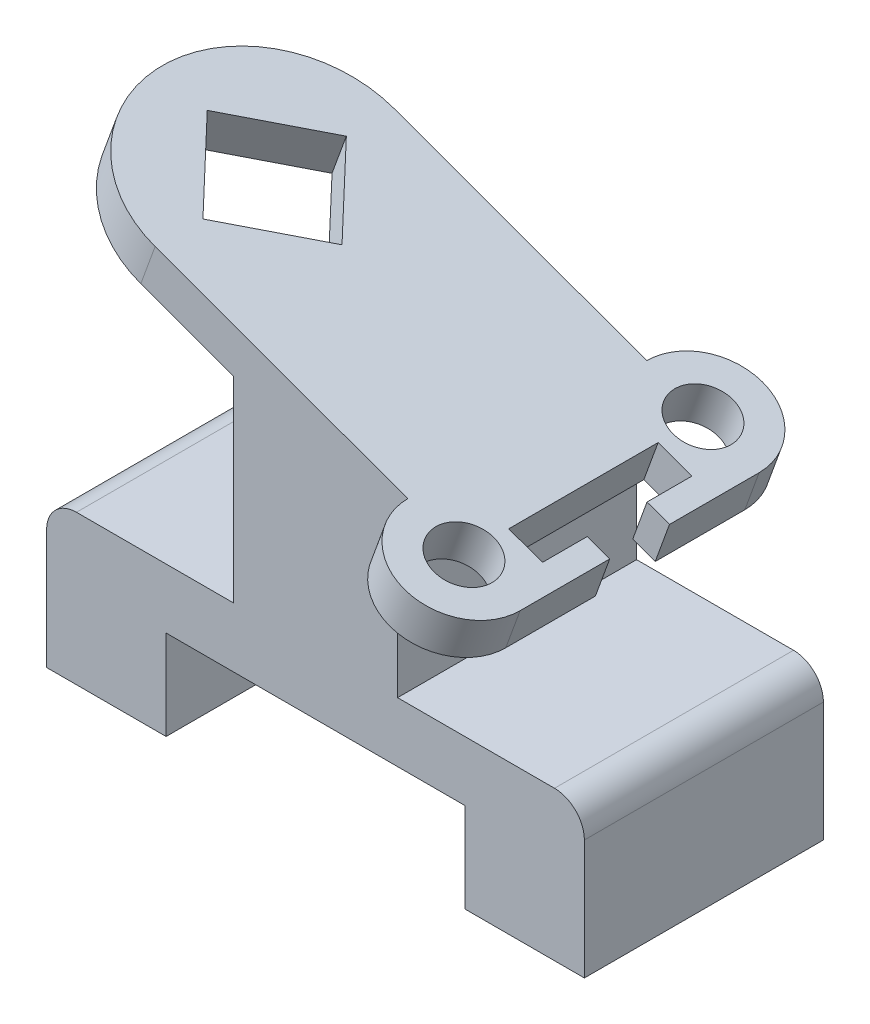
ISO-10303-21;
HEADER;
FILE_DESCRIPTION(('STEP AP214'),'2;1');
FILE_NAME('part.step','',(''),(''),'','','');
FILE_SCHEMA(('AUTOMOTIVE_DESIGN { 1 0 10303 214 1 1 1 1 }'));
ENDSEC;
DATA;
#1=APPLICATION_CONTEXT('core data for automotive mechanical design processes');
#2=APPLICATION_PROTOCOL_DEFINITION('international standard','automotive_design',2000,#1);
#3=PRODUCT_CONTEXT('',#1,'mechanical');
#4=PRODUCT('Part','Part','',(#3));
#5=PRODUCT_RELATED_PRODUCT_CATEGORY('part','',(#4));
#6=PRODUCT_DEFINITION_FORMATION('','',#4);
#7=PRODUCT_DEFINITION_CONTEXT('part definition',#1,'design');
#8=PRODUCT_DEFINITION('design','',#6,#7);
#9=PRODUCT_DEFINITION_SHAPE('','',#8);
#10=(LENGTH_UNIT() NAMED_UNIT(*) SI_UNIT(.MILLI.,.METRE.));
#11=(NAMED_UNIT(*) PLANE_ANGLE_UNIT() SI_UNIT($,.RADIAN.));
#12=(NAMED_UNIT(*) SI_UNIT($,.STERADIAN.) SOLID_ANGLE_UNIT());
#13=UNCERTAINTY_MEASURE_WITH_UNIT(LENGTH_MEASURE(1.E-05),#10,'distance_accuracy_value','');
#14=(GEOMETRIC_REPRESENTATION_CONTEXT(3) GLOBAL_UNCERTAINTY_ASSIGNED_CONTEXT((#13)) GLOBAL_UNIT_ASSIGNED_CONTEXT((#10,
#11,#12)) REPRESENTATION_CONTEXT('',''));
#15=CARTESIAN_POINT('',(0.,0.,0.));
#16=DIRECTION('',(0.,0.,1.));
#17=DIRECTION('',(1.,0.,0.));
#18=AXIS2_PLACEMENT_3D('',#15,#16,#17);
#19=CARTESIAN_POINT('',(24.8444140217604,51.2782616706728,20.));
#20=DIRECTION('',(-0.342020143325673,-0.939692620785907,0.));
#21=DIRECTION('',(0.939692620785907,-0.342020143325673,0.));
#22=AXIS2_PLACEMENT_3D('',#19,#20,#21);
#23=PLANE('',#22);
#24=DIRECTION('',(0.664463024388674,-0.241844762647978,-0.707106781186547));
#25=VECTOR('',#24,1.);
#26=CARTESIAN_POINT('',(-26.8386801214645,70.0893695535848,12.));
#27=LINE('',#26,#25);
#28=CARTESIAN_POINT('',(-26.8386801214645,70.0893695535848,12.));
#29=VERTEX_POINT('',#28);
#30=CARTESIAN_POINT('',(-15.5623686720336,65.9851278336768,0.));
#31=VERTEX_POINT('',#30);
#32=EDGE_CURVE('E255',#29,#31,#27,.T.);
#33=ORIENTED_EDGE('',*,*,#32,.F.);
#34=DIRECTION('',(0.664463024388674,-0.241844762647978,0.707106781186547));
#35=VECTOR('',#34,1.);
#36=CARTESIAN_POINT('',(-38.1149915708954,74.1936112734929,0.));
#37=LINE('',#36,#35);
#38=CARTESIAN_POINT('',(-38.1149915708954,74.1936112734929,0.));
#39=VERTEX_POINT('',#38);
#40=EDGE_CURVE('E267',#39,#29,#37,.T.);
#41=ORIENTED_EDGE('',*,*,#40,.F.);
#42=DIRECTION('',(-0.664463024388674,0.241844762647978,0.707106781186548));
#43=VECTOR('',#42,1.);
#44=CARTESIAN_POINT('',(-26.8386801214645,70.0893695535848,-12.));
#45=LINE('',#44,#43);
#46=CARTESIAN_POINT('',(-26.8386801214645,70.0893695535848,-12.));
#47=VERTEX_POINT('',#46);
#48=EDGE_CURVE('E265',#47,#39,#45,.T.);
#49=ORIENTED_EDGE('',*,*,#48,.F.);
#50=DIRECTION('',(-0.664463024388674,0.241844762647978,-0.707106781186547));
#51=VECTOR('',#50,1.);
#52=CARTESIAN_POINT('',(-15.5623686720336,65.9851278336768,0.));
#53=LINE('',#52,#51);
#54=EDGE_CURVE('E47',#31,#47,#53,.T.);
#55=ORIENTED_EDGE('',*,*,#54,.F.);
#56=EDGE_LOOP('',(#33,#41,#49,#55));
#57=FACE_BOUND('',#56,.T.);
#58=CARTESIAN_POINT('',(24.8444140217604,51.2782616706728,20.));
#59=DIRECTION('',(0.342020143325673,0.939692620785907,0.));
#60=DIRECTION('',(-0.939692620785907,0.342020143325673,0.));
#61=AXIS2_PLACEMENT_3D('',#58,#59,#60);
#62=CIRCLE('',#61,4.99999999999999);
#63=CARTESIAN_POINT('',(20.1459509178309,52.9883623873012,20.));
#64=VERTEX_POINT('',#63);
#65=EDGE_CURVE('E282',#64,#64,#62,.T.);
#66=ORIENTED_EDGE('',*,*,#65,.F.);
#67=EDGE_LOOP('',(#66));
#68=FACE_BOUND('',#67,.T.);
#69=DIRECTION('',(0.939692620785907,-0.342020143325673,0.));
#70=VECTOR('',#69,1.);
#71=CARTESIAN_POINT('',(30.4825697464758,49.2261408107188,-12.5));
#72=LINE('',#71,#70);
#73=CARTESIAN_POINT('',(24.8444140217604,51.2782616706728,-12.5));
#74=VERTEX_POINT('',#73);
#75=CARTESIAN_POINT('',(30.4825697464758,49.2261408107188,-12.5));
#76=VERTEX_POINT('',#75);
#77=EDGE_CURVE('E329',#74,#76,#72,.T.);
#78=ORIENTED_EDGE('',*,*,#77,.T.);
#79=DIRECTION('',(0.,0.,1.));
#80=VECTOR('',#79,1.);
#81=CARTESIAN_POINT('',(30.4825697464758,49.2261408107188,-5.));
#82=LINE('',#81,#80);
#83=CARTESIAN_POINT('',(30.4825697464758,49.2261408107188,-5.));
#84=VERTEX_POINT('',#83);
#85=EDGE_CURVE('E332',#76,#84,#82,.T.);
#86=ORIENTED_EDGE('',*,*,#85,.T.);
#87=DIRECTION('',(0.939692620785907,-0.342020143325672,0.));
#88=VECTOR('',#87,1.);
#89=CARTESIAN_POINT('',(34.2413402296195,47.8580602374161,-4.99999999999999));
#90=LINE('',#89,#88);
#91=CARTESIAN_POINT('',(34.2413402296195,47.8580602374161,-4.99999999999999));
#92=VERTEX_POINT('',#91);
#93=EDGE_CURVE('E334',#84,#92,#90,.T.);
#94=ORIENTED_EDGE('',*,*,#93,.T.);
#95=DIRECTION('',(0.,0.,-1.));
#96=VECTOR('',#95,1.);
#97=CARTESIAN_POINT('',(34.2413402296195,47.8580602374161,-4.99999999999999));
#98=LINE('',#97,#96);
#99=CARTESIAN_POINT('',(34.2413402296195,47.8580602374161,-20.));
#100=VERTEX_POINT('',#99);
#101=EDGE_CURVE('E336',#92,#100,#98,.T.);
#102=ORIENTED_EDGE('',*,*,#101,.T.);
#103=CARTESIAN_POINT('',(24.8444140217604,51.2782616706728,-20.));
#104=DIRECTION('',(0.342020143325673,0.939692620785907,0.));
#105=DIRECTION('',(-0.939692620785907,0.342020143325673,0.));
#106=AXIS2_PLACEMENT_3D('',#103,#104,#105);
#107=CIRCLE('',#106,10.);
#108=CARTESIAN_POINT('',(15.4474878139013,54.6984631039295,-20.));
#109=VERTEX_POINT('',#108);
#110=EDGE_CURVE('E338',#100,#109,#107,.T.);
#111=ORIENTED_EDGE('',*,*,#110,.T.);
#112=DIRECTION('',(-0.939692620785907,0.342020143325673,0.));
#113=VECTOR('',#112,1.);
#114=CARTESIAN_POINT('',(15.4474878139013,54.6984631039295,-20.));
#115=LINE('',#114,#113);
#116=CARTESIAN_POINT('',(-26.8386801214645,70.0893695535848,-20.));
#117=VERTEX_POINT('',#116);
#118=EDGE_CURVE('E341',#109,#117,#115,.T.);
#119=ORIENTED_EDGE('',*,*,#118,.T.);
#120=CARTESIAN_POINT('',(-26.8386801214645,70.0893695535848,0.));
#121=DIRECTION('',(0.342020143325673,0.939692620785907,0.));
#122=DIRECTION('',(-0.939692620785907,0.342020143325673,0.));
#123=AXIS2_PLACEMENT_3D('',#120,#121,#122);
#124=CIRCLE('',#123,20.);
#125=CARTESIAN_POINT('',(-26.8386801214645,70.0893695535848,20.));
#126=VERTEX_POINT('',#125);
#127=EDGE_CURVE('E343',#117,#126,#124,.T.);
#128=ORIENTED_EDGE('',*,*,#127,.T.);
#129=DIRECTION('',(0.939692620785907,-0.342020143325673,0.));
#130=VECTOR('',#129,1.);
#131=CARTESIAN_POINT('',(15.4474878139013,54.6984631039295,20.));
#132=LINE('',#131,#130);
#133=CARTESIAN_POINT('',(15.4474878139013,54.6984631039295,20.));
#134=VERTEX_POINT('',#133);
#135=EDGE_CURVE('E345',#126,#134,#132,.T.);
#136=ORIENTED_EDGE('',*,*,#135,.T.);
#137=CARTESIAN_POINT('',(24.8444140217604,51.2782616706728,20.));
#138=DIRECTION('',(0.342020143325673,0.939692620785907,0.));
#139=DIRECTION('',(0.939692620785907,-0.342020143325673,0.));
#140=AXIS2_PLACEMENT_3D('',#137,#138,#139);
#141=CIRCLE('',#140,10.);
#142=CARTESIAN_POINT('',(34.2413402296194,47.8580602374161,20.));
#143=VERTEX_POINT('',#142);
#144=EDGE_CURVE('E348',#134,#143,#141,.T.);
#145=ORIENTED_EDGE('',*,*,#144,.T.);
#146=DIRECTION('',(0.,0.,-1.));
#147=VECTOR('',#146,1.);
#148=CARTESIAN_POINT('',(34.2413402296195,47.8580602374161,4.99999999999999));
#149=LINE('',#148,#147);
#150=CARTESIAN_POINT('',(34.2413402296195,47.8580602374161,4.99999999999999));
#151=VERTEX_POINT('',#150);
#152=EDGE_CURVE('E350',#143,#151,#149,.T.);
#153=ORIENTED_EDGE('',*,*,#152,.T.);
#154=DIRECTION('',(-0.939692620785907,0.342020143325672,0.));
#155=VECTOR('',#154,1.);
#156=CARTESIAN_POINT('',(34.2413402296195,47.8580602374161,4.99999999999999));
#157=LINE('',#156,#155);
#158=CARTESIAN_POINT('',(30.4825697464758,49.2261408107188,5.));
#159=VERTEX_POINT('',#158);
#160=EDGE_CURVE('E352',#151,#159,#157,.T.);
#161=ORIENTED_EDGE('',*,*,#160,.T.);
#162=DIRECTION('',(0.,0.,1.));
#163=VECTOR('',#162,1.);
#164=CARTESIAN_POINT('',(30.4825697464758,49.2261408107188,5.));
#165=LINE('',#164,#163);
#166=CARTESIAN_POINT('',(30.4825697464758,49.2261408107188,12.5));
#167=VERTEX_POINT('',#166);
#168=EDGE_CURVE('E354',#159,#167,#165,.T.);
#169=ORIENTED_EDGE('',*,*,#168,.T.);
#170=DIRECTION('',(-0.939692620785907,0.342020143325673,0.));
#171=VECTOR('',#170,1.);
#172=CARTESIAN_POINT('',(30.4825697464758,49.2261408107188,12.5));
#173=LINE('',#172,#171);
#174=CARTESIAN_POINT('',(24.8444140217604,51.2782616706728,12.5));
#175=VERTEX_POINT('',#174);
#176=EDGE_CURVE('E356',#167,#175,#173,.T.);
#177=ORIENTED_EDGE('',*,*,#176,.T.);
#178=DIRECTION('',(0.,0.,-1.));
#179=VECTOR('',#178,1.);
#180=CARTESIAN_POINT('',(24.8444140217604,51.2782616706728,12.5));
#181=LINE('',#180,#179);
#182=EDGE_CURVE('E358',#175,#74,#181,.T.);
#183=ORIENTED_EDGE('',*,*,#182,.T.);
#184=EDGE_LOOP('',(#78,#86,#94,#102,#111,#119,#128,#136,#145,#153,#161,#169,#177,#183));
#185=FACE_BOUND('',#184,.T.);
#186=CARTESIAN_POINT('',(24.8444140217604,51.2782616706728,-20.));
#187=DIRECTION('',(0.342020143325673,0.939692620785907,0.));
#188=DIRECTION('',(-0.939692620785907,0.342020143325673,0.));
#189=AXIS2_PLACEMENT_3D('',#186,#187,#188);
#190=CIRCLE('',#189,4.99999999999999);
#191=CARTESIAN_POINT('',(20.1459509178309,52.9883623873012,-20.));
#192=VERTEX_POINT('',#191);
#193=EDGE_CURVE('E276',#192,#192,#190,.T.);
#194=ORIENTED_EDGE('',*,*,#193,.F.);
#195=EDGE_LOOP('',(#194));
#196=FACE_BOUND('',#195,.T.);
#197=ADVANCED_FACE('F32',(#57,#68,#185,#196),#23,.F.);
#198=CARTESIAN_POINT('',(25.,0.,20.));
#199=DIRECTION('',(0.,1.,0.));
#200=DIRECTION('',(-1.,0.,0.));
#201=AXIS2_PLACEMENT_3D('',#198,#199,#200);
#202=PLANE('',#201);
#203=DIRECTION('',(1.,0.,0.));
#204=VECTOR('',#203,1.);
#205=CARTESIAN_POINT('',(25.,0.,-20.));
#206=LINE('',#205,#204);
#207=CARTESIAN_POINT('',(25.,0.,-20.));
#208=VERTEX_POINT('',#207);
#209=CARTESIAN_POINT('',(45.,0.,-20.));
#210=VERTEX_POINT('',#209);
#211=EDGE_CURVE('E393',#208,#210,#206,.T.);
#212=ORIENTED_EDGE('',*,*,#211,.T.);
#213=DIRECTION('',(0.,0.,-1.));
#214=VECTOR('',#213,1.);
#215=CARTESIAN_POINT('',(45.,0.,20.));
#216=LINE('',#215,#214);
#217=CARTESIAN_POINT('',(45.,0.,20.));
#218=VERTEX_POINT('',#217);
#219=EDGE_CURVE('E482',#218,#210,#216,.T.);
#220=ORIENTED_EDGE('',*,*,#219,.F.);
#221=DIRECTION('',(1.,0.,0.));
#222=VECTOR('',#221,1.);
#223=CARTESIAN_POINT('',(25.,0.,20.));
#224=LINE('',#223,#222);
#225=CARTESIAN_POINT('',(25.,0.,20.));
#226=VERTEX_POINT('',#225);
#227=EDGE_CURVE('E421',#226,#218,#224,.T.);
#228=ORIENTED_EDGE('',*,*,#227,.F.);
#229=DIRECTION('',(0.,0.,-1.));
#230=VECTOR('',#229,1.);
#231=CARTESIAN_POINT('',(25.,0.,20.));
#232=LINE('',#231,#230);
#233=EDGE_CURVE('E449',#226,#208,#232,.T.);
#234=ORIENTED_EDGE('',*,*,#233,.T.);
#235=EDGE_LOOP('',(#212,#220,#228,#234));
#236=FACE_BOUND('',#235,.T.);
#237=ADVANCED_FACE('F34',(#236),#202,.F.);
#238=CARTESIAN_POINT('',(45.,0.,20.));
#239=DIRECTION('',(-1.,0.,0.));
#240=DIRECTION('',(0.,-1.,0.));
#241=AXIS2_PLACEMENT_3D('',#238,#239,#240);
#242=PLANE('',#241);
#243=DIRECTION('',(0.,1.,0.));
#244=VECTOR('',#243,1.);
#245=CARTESIAN_POINT('',(45.,0.,-20.));
#246=LINE('',#245,#244);
#247=CARTESIAN_POINT('',(45.,20.,-20.));
#248=VERTEX_POINT('',#247);
#249=EDGE_CURVE('E396',#210,#248,#246,.T.);
#250=ORIENTED_EDGE('',*,*,#249,.T.);
#251=DIRECTION('',(0.,0.,-1.));
#252=VECTOR('',#251,1.);
#253=CARTESIAN_POINT('',(45.,20.,20.));
#254=LINE('',#253,#252);
#255=CARTESIAN_POINT('',(45.,20.,20.));
#256=VERTEX_POINT('',#255);
#257=EDGE_CURVE('E479',#256,#248,#254,.T.);
#258=ORIENTED_EDGE('',*,*,#257,.F.);
#259=DIRECTION('',(0.,1.,0.));
#260=VECTOR('',#259,1.);
#261=CARTESIAN_POINT('',(45.,0.,20.));
#262=LINE('',#261,#260);
#263=EDGE_CURVE('E424',#218,#256,#262,.T.);
#264=ORIENTED_EDGE('',*,*,#263,.F.);
#265=ORIENTED_EDGE('',*,*,#219,.T.);
#266=EDGE_LOOP('',(#250,#258,#264,#265));
#267=FACE_BOUND('',#266,.T.);
#268=ADVANCED_FACE('F574',(#267),#242,.F.);
#269=CARTESIAN_POINT('',(40.,20.,20.));
#270=DIRECTION('',(0.,0.,-1.));
#271=DIRECTION('',(-1.,0.,0.));
#272=AXIS2_PLACEMENT_3D('',#269,#270,#271);
#273=CYLINDRICAL_SURFACE('',#272,5.);
#274=CARTESIAN_POINT('',(40.,20.,-20.));
#275=DIRECTION('',(0.,0.,1.));
#276=DIRECTION('',(1.,0.,0.));
#277=AXIS2_PLACEMENT_3D('',#274,#275,#276);
#278=CIRCLE('',#277,5.);
#279=CARTESIAN_POINT('',(40.,25.,-20.));
#280=VERTEX_POINT('',#279);
#281=EDGE_CURVE('E398',#248,#280,#278,.T.);
#282=ORIENTED_EDGE('',*,*,#281,.T.);
#283=DIRECTION('',(0.,0.,-1.));
#284=VECTOR('',#283,1.);
#285=CARTESIAN_POINT('',(40.,25.,20.));
#286=LINE('',#285,#284);
#287=CARTESIAN_POINT('',(40.,25.,20.));
#288=VERTEX_POINT('',#287);
#289=EDGE_CURVE('E476',#288,#280,#286,.T.);
#290=ORIENTED_EDGE('',*,*,#289,.F.);
#291=CARTESIAN_POINT('',(40.,20.,20.));
#292=DIRECTION('',(0.,0.,1.));
#293=DIRECTION('',(1.,0.,0.));
#294=AXIS2_PLACEMENT_3D('',#291,#292,#293);
#295=CIRCLE('',#294,5.);
#296=EDGE_CURVE('E426',#256,#288,#295,.T.);
#297=ORIENTED_EDGE('',*,*,#296,.F.);
#298=ORIENTED_EDGE('',*,*,#257,.T.);
#299=EDGE_LOOP('',(#282,#290,#297,#298));
#300=FACE_BOUND('',#299,.T.);
#301=ADVANCED_FACE('F570',(#300),#273,.T.);
#302=CARTESIAN_POINT('',(40.,25.,20.));
#303=DIRECTION('',(0.,-1.,0.));
#304=DIRECTION('',(0.,0.,-1.));
#305=AXIS2_PLACEMENT_3D('',#302,#303,#304);
#306=PLANE('',#305);
#307=DIRECTION('',(-1.,0.,0.));
#308=VECTOR('',#307,1.);
#309=CARTESIAN_POINT('',(40.,25.,-20.));
#310=LINE('',#309,#308);
#311=CARTESIAN_POINT('',(13.7373870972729,25.,-20.));
#312=VERTEX_POINT('',#311);
#313=EDGE_CURVE('E400',#280,#312,#310,.T.);
#314=ORIENTED_EDGE('',*,*,#313,.T.);
#315=DIRECTION('',(0.,0.,-1.));
#316=VECTOR('',#315,1.);
#317=CARTESIAN_POINT('',(13.7373870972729,25.,20.));
#318=LINE('',#317,#316);
#319=CARTESIAN_POINT('',(13.7373870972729,25.,20.));
#320=VERTEX_POINT('',#319);
#321=EDGE_CURVE('E473',#320,#312,#318,.T.);
#322=ORIENTED_EDGE('',*,*,#321,.F.);
#323=DIRECTION('',(-1.,0.,0.));
#324=VECTOR('',#323,1.);
#325=CARTESIAN_POINT('',(40.,25.,20.));
#326=LINE('',#325,#324);
#327=EDGE_CURVE('E428',#288,#320,#326,.T.);
#328=ORIENTED_EDGE('',*,*,#327,.F.);
#329=ORIENTED_EDGE('',*,*,#289,.T.);
#330=EDGE_LOOP('',(#314,#322,#328,#329));
#331=FACE_BOUND('',#330,.T.);
#332=ADVANCED_FACE('F565',(#331),#306,.F.);
#333=CARTESIAN_POINT('',(13.7373870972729,25.,20.));
#334=DIRECTION('',(-1.,0.,0.));
#335=DIRECTION('',(0.,0.,1.));
#336=AXIS2_PLACEMENT_3D('',#333,#334,#335);
#337=PLANE('',#336);
#338=DIRECTION('',(0.,1.,0.));
#339=VECTOR('',#338,1.);
#340=CARTESIAN_POINT('',(13.7373870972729,25.,-20.));
#341=LINE('',#340,#339);
#342=CARTESIAN_POINT('',(13.7373870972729,47.8716444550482,-20.));
#343=VERTEX_POINT('',#342);
#344=EDGE_CURVE('E402',#312,#343,#341,.T.);
#345=ORIENTED_EDGE('',*,*,#344,.T.);
#346=DIRECTION('',(0.,0.,1.));
#347=VECTOR('',#346,1.);
#348=CARTESIAN_POINT('',(13.7373870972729,47.8716444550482,20.));
#349=LINE('',#348,#347);
#350=CARTESIAN_POINT('',(13.7373870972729,47.8716444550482,20.));
#351=VERTEX_POINT('',#350);
#352=EDGE_CURVE('E385',#343,#351,#349,.T.);
#353=ORIENTED_EDGE('',*,*,#352,.T.);
#354=DIRECTION('',(0.,1.,0.));
#355=VECTOR('',#354,1.);
#356=CARTESIAN_POINT('',(13.7373870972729,25.,20.));
#357=LINE('',#356,#355);
#358=EDGE_CURVE('E430',#320,#351,#357,.T.);
#359=ORIENTED_EDGE('',*,*,#358,.F.);
#360=ORIENTED_EDGE('',*,*,#321,.T.);
#361=EDGE_LOOP('',(#345,#353,#359,#360));
#362=FACE_BOUND('',#361,.T.);
#363=ADVANCED_FACE('F560',(#362),#337,.F.);
#364=CARTESIAN_POINT('',(-13.7373870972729,25.,20.));
#365=DIRECTION('',(1.,0.,0.));
#366=DIRECTION('',(0.,1.,0.));
#367=AXIS2_PLACEMENT_3D('',#364,#365,#366);
#368=PLANE('',#367);
#369=DIRECTION('',(0.,-1.,0.));
#370=VECTOR('',#369,1.);
#371=CARTESIAN_POINT('',(-13.7373870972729,25.,20.));
#372=LINE('',#371,#370);
#373=CARTESIAN_POINT('',(-13.7373870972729,57.8716444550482,20.));
#374=VERTEX_POINT('',#373);
#375=CARTESIAN_POINT('',(-13.7373870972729,25.,20.));
#376=VERTEX_POINT('',#375);
#377=EDGE_CURVE('E433',#374,#376,#372,.T.);
#378=ORIENTED_EDGE('',*,*,#377,.F.);
#379=DIRECTION('',(0.,0.,-1.));
#380=VECTOR('',#379,1.);
#381=CARTESIAN_POINT('',(-13.7373870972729,57.8716444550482,20.));
#382=LINE('',#381,#380);
#383=CARTESIAN_POINT('',(-13.7373870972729,57.8716444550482,-20.));
#384=VERTEX_POINT('',#383);
#385=EDGE_CURVE('E390',#374,#384,#382,.T.);
#386=ORIENTED_EDGE('',*,*,#385,.T.);
#387=DIRECTION('',(0.,-1.,0.));
#388=VECTOR('',#387,1.);
#389=CARTESIAN_POINT('',(-13.7373870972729,25.,-20.));
#390=LINE('',#389,#388);
#391=CARTESIAN_POINT('',(-13.7373870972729,25.,-20.));
#392=VERTEX_POINT('',#391);
#393=EDGE_CURVE('E405',#384,#392,#390,.T.);
#394=ORIENTED_EDGE('',*,*,#393,.T.);
#395=DIRECTION('',(0.,0.,-1.));
#396=VECTOR('',#395,1.);
#397=CARTESIAN_POINT('',(-13.7373870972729,25.,20.));
#398=LINE('',#397,#396);
#399=EDGE_CURVE('E470',#376,#392,#398,.T.);
#400=ORIENTED_EDGE('',*,*,#399,.F.);
#401=EDGE_LOOP('',(#378,#386,#394,#400));
#402=FACE_BOUND('',#401,.T.);
#403=ADVANCED_FACE('F616',(#402),#368,.F.);
#404=CARTESIAN_POINT('',(-40.,25.,20.));
#405=DIRECTION('',(0.,-1.,0.));
#406=DIRECTION('',(1.,0.,0.));
#407=AXIS2_PLACEMENT_3D('',#404,#405,#406);
#408=PLANE('',#407);
#409=DIRECTION('',(-1.,0.,0.));
#410=VECTOR('',#409,1.);
#411=CARTESIAN_POINT('',(-40.,25.,-20.));
#412=LINE('',#411,#410);
#413=CARTESIAN_POINT('',(-40.,25.,-20.));
#414=VERTEX_POINT('',#413);
#415=EDGE_CURVE('E407',#392,#414,#412,.T.);
#416=ORIENTED_EDGE('',*,*,#415,.T.);
#417=DIRECTION('',(0.,0.,-1.));
#418=VECTOR('',#417,1.);
#419=CARTESIAN_POINT('',(-40.,25.,20.));
#420=LINE('',#419,#418);
#421=CARTESIAN_POINT('',(-40.,25.,20.));
#422=VERTEX_POINT('',#421);
#423=EDGE_CURVE('E467',#422,#414,#420,.T.);
#424=ORIENTED_EDGE('',*,*,#423,.F.);
#425=DIRECTION('',(-1.,0.,0.));
#426=VECTOR('',#425,1.);
#427=CARTESIAN_POINT('',(-40.,25.,20.));
#428=LINE('',#427,#426);
#429=EDGE_CURVE('E435',#376,#422,#428,.T.);
#430=ORIENTED_EDGE('',*,*,#429,.F.);
#431=ORIENTED_EDGE('',*,*,#399,.T.);
#432=EDGE_LOOP('',(#416,#424,#430,#431));
#433=FACE_BOUND('',#432,.T.);
#434=ADVANCED_FACE('F611',(#433),#408,.F.);
#435=CARTESIAN_POINT('',(-40.,20.,20.));
#436=DIRECTION('',(0.,0.,-1.));
#437=DIRECTION('',(-1.,0.,0.));
#438=AXIS2_PLACEMENT_3D('',#435,#436,#437);
#439=CYLINDRICAL_SURFACE('',#438,5.);
#440=CARTESIAN_POINT('',(-40.,20.,-20.));
#441=DIRECTION('',(0.,0.,1.));
#442=DIRECTION('',(-1.,0.,0.));
#443=AXIS2_PLACEMENT_3D('',#440,#441,#442);
#444=CIRCLE('',#443,5.);
#445=CARTESIAN_POINT('',(-45.,20.,-20.));
#446=VERTEX_POINT('',#445);
#447=EDGE_CURVE('E409',#414,#446,#444,.T.);
#448=ORIENTED_EDGE('',*,*,#447,.T.);
#449=DIRECTION('',(0.,0.,-1.));
#450=VECTOR('',#449,1.);
#451=CARTESIAN_POINT('',(-45.,20.,20.));
#452=LINE('',#451,#450);
#453=CARTESIAN_POINT('',(-45.,20.,20.));
#454=VERTEX_POINT('',#453);
#455=EDGE_CURVE('E464',#454,#446,#452,.T.);
#456=ORIENTED_EDGE('',*,*,#455,.F.);
#457=CARTESIAN_POINT('',(-40.,20.,20.));
#458=DIRECTION('',(0.,0.,1.));
#459=DIRECTION('',(-1.,0.,0.));
#460=AXIS2_PLACEMENT_3D('',#457,#458,#459);
#461=CIRCLE('',#460,5.);
#462=EDGE_CURVE('E437',#422,#454,#461,.T.);
#463=ORIENTED_EDGE('',*,*,#462,.F.);
#464=ORIENTED_EDGE('',*,*,#423,.T.);
#465=EDGE_LOOP('',(#448,#456,#463,#464));
#466=FACE_BOUND('',#465,.T.);
#467=ADVANCED_FACE('F607',(#466),#439,.T.);
#468=CARTESIAN_POINT('',(-45.,0.,20.));
#469=DIRECTION('',(1.,0.,0.));
#470=DIRECTION('',(0.,1.,0.));
#471=AXIS2_PLACEMENT_3D('',#468,#469,#470);
#472=PLANE('',#471);
#473=DIRECTION('',(0.,-1.,0.));
#474=VECTOR('',#473,1.);
#475=CARTESIAN_POINT('',(-45.,0.,-20.));
#476=LINE('',#475,#474);
#477=CARTESIAN_POINT('',(-45.,0.,-20.));
#478=VERTEX_POINT('',#477);
#479=EDGE_CURVE('E411',#446,#478,#476,.T.);
#480=ORIENTED_EDGE('',*,*,#479,.T.);
#481=DIRECTION('',(0.,0.,-1.));
#482=VECTOR('',#481,1.);
#483=CARTESIAN_POINT('',(-45.,0.,20.));
#484=LINE('',#483,#482);
#485=CARTESIAN_POINT('',(-45.,0.,20.));
#486=VERTEX_POINT('',#485);
#487=EDGE_CURVE('E461',#486,#478,#484,.T.);
#488=ORIENTED_EDGE('',*,*,#487,.F.);
#489=DIRECTION('',(0.,-1.,0.));
#490=VECTOR('',#489,1.);
#491=CARTESIAN_POINT('',(-45.,0.,20.));
#492=LINE('',#491,#490);
#493=EDGE_CURVE('E439',#454,#486,#492,.T.);
#494=ORIENTED_EDGE('',*,*,#493,.F.);
#495=ORIENTED_EDGE('',*,*,#455,.T.);
#496=EDGE_LOOP('',(#480,#488,#494,#495));
#497=FACE_BOUND('',#496,.T.);
#498=ADVANCED_FACE('F603',(#497),#472,.F.);
#499=CARTESIAN_POINT('',(-25.,0.,20.));
#500=DIRECTION('',(0.,1.,0.));
#501=DIRECTION('',(-1.,0.,0.));
#502=AXIS2_PLACEMENT_3D('',#499,#500,#501);
#503=PLANE('',#502);
#504=DIRECTION('',(1.,0.,0.));
#505=VECTOR('',#504,1.);
#506=CARTESIAN_POINT('',(-25.,0.,-20.));
#507=LINE('',#506,#505);
#508=CARTESIAN_POINT('',(-25.,0.,-20.));
#509=VERTEX_POINT('',#508);
#510=EDGE_CURVE('E413',#478,#509,#507,.T.);
#511=ORIENTED_EDGE('',*,*,#510,.T.);
#512=DIRECTION('',(0.,0.,-1.));
#513=VECTOR('',#512,1.);
#514=CARTESIAN_POINT('',(-25.,0.,20.));
#515=LINE('',#514,#513);
#516=CARTESIAN_POINT('',(-25.,0.,20.));
#517=VERTEX_POINT('',#516);
#518=EDGE_CURVE('E458',#517,#509,#515,.T.);
#519=ORIENTED_EDGE('',*,*,#518,.F.);
#520=DIRECTION('',(1.,0.,0.));
#521=VECTOR('',#520,1.);
#522=CARTESIAN_POINT('',(-25.,0.,20.));
#523=LINE('',#522,#521);
#524=EDGE_CURVE('E441',#486,#517,#523,.T.);
#525=ORIENTED_EDGE('',*,*,#524,.F.);
#526=ORIENTED_EDGE('',*,*,#487,.T.);
#527=EDGE_LOOP('',(#511,#519,#525,#526));
#528=FACE_BOUND('',#527,.T.);
#529=ADVANCED_FACE('F598',(#528),#503,.F.);
#530=CARTESIAN_POINT('',(-25.,15.,20.));
#531=DIRECTION('',(-1.,0.,0.));
#532=DIRECTION('',(0.,-1.,0.));
#533=AXIS2_PLACEMENT_3D('',#530,#531,#532);
#534=PLANE('',#533);
#535=DIRECTION('',(0.,1.,0.));
#536=VECTOR('',#535,1.);
#537=CARTESIAN_POINT('',(-25.,15.,-20.));
#538=LINE('',#537,#536);
#539=CARTESIAN_POINT('',(-25.,15.,-20.));
#540=VERTEX_POINT('',#539);
#541=EDGE_CURVE('E415',#509,#540,#538,.T.);
#542=ORIENTED_EDGE('',*,*,#541,.T.);
#543=DIRECTION('',(0.,0.,-1.));
#544=VECTOR('',#543,1.);
#545=CARTESIAN_POINT('',(-25.,15.,20.));
#546=LINE('',#545,#544);
#547=CARTESIAN_POINT('',(-25.,15.,20.));
#548=VERTEX_POINT('',#547);
#549=EDGE_CURVE('E455',#548,#540,#546,.T.);
#550=ORIENTED_EDGE('',*,*,#549,.F.);
#551=DIRECTION('',(0.,1.,0.));
#552=VECTOR('',#551,1.);
#553=CARTESIAN_POINT('',(-25.,15.,20.));
#554=LINE('',#553,#552);
#555=EDGE_CURVE('E443',#517,#548,#554,.T.);
#556=ORIENTED_EDGE('',*,*,#555,.F.);
#557=ORIENTED_EDGE('',*,*,#518,.T.);
#558=EDGE_LOOP('',(#542,#550,#556,#557));
#559=FACE_BOUND('',#558,.T.);
#560=ADVANCED_FACE('F592',(#559),#534,.F.);
#561=CARTESIAN_POINT('',(25.,15.,20.));
#562=DIRECTION('',(0.,1.,0.));
#563=DIRECTION('',(0.,0.,1.));
#564=AXIS2_PLACEMENT_3D('',#561,#562,#563);
#565=PLANE('',#564);
#566=DIRECTION('',(1.,0.,0.));
#567=VECTOR('',#566,1.);
#568=CARTESIAN_POINT('',(25.,15.,-20.));
#569=LINE('',#568,#567);
#570=CARTESIAN_POINT('',(25.,15.,-20.));
#571=VERTEX_POINT('',#570);
#572=EDGE_CURVE('E417',#540,#571,#569,.T.);
#573=ORIENTED_EDGE('',*,*,#572,.T.);
#574=DIRECTION('',(0.,0.,-1.));
#575=VECTOR('',#574,1.);
#576=CARTESIAN_POINT('',(25.,15.,20.));
#577=LINE('',#576,#575);
#578=CARTESIAN_POINT('',(25.,15.,20.));
#579=VERTEX_POINT('',#578);
#580=EDGE_CURVE('E452',#579,#571,#577,.T.);
#581=ORIENTED_EDGE('',*,*,#580,.F.);
#582=DIRECTION('',(1.,0.,0.));
#583=VECTOR('',#582,1.);
#584=CARTESIAN_POINT('',(25.,15.,20.));
#585=LINE('',#584,#583);
#586=EDGE_CURVE('E445',#548,#579,#585,.T.);
#587=ORIENTED_EDGE('',*,*,#586,.F.);
#588=ORIENTED_EDGE('',*,*,#549,.T.);
#589=EDGE_LOOP('',(#573,#581,#587,#588));
#590=FACE_BOUND('',#589,.T.);
#591=ADVANCED_FACE('F588',(#590),#565,.F.);
#592=CARTESIAN_POINT('',(25.,15.,20.));
#593=DIRECTION('',(1.,0.,0.));
#594=DIRECTION('',(0.,1.,0.));
#595=AXIS2_PLACEMENT_3D('',#592,#593,#594);
#596=PLANE('',#595);
#597=DIRECTION('',(0.,-1.,0.));
#598=VECTOR('',#597,1.);
#599=CARTESIAN_POINT('',(25.,15.,-20.));
#600=LINE('',#599,#598);
#601=EDGE_CURVE('E419',#571,#208,#600,.T.);
#602=ORIENTED_EDGE('',*,*,#601,.T.);
#603=ORIENTED_EDGE('',*,*,#233,.F.);
#604=DIRECTION('',(0.,-1.,0.));
#605=VECTOR('',#604,1.);
#606=CARTESIAN_POINT('',(25.,15.,20.));
#607=LINE('',#606,#605);
#608=EDGE_CURVE('E447',#579,#226,#607,.T.);
#609=ORIENTED_EDGE('',*,*,#608,.F.);
#610=ORIENTED_EDGE('',*,*,#580,.T.);
#611=EDGE_LOOP('',(#602,#603,#609,#610));
#612=FACE_BOUND('',#611,.T.);
#613=ADVANCED_FACE('F583',(#612),#596,.F.);
#614=CARTESIAN_POINT('',(40.,20.,20.));
#615=DIRECTION('',(0.,0.,1.));
#616=DIRECTION('',(1.,0.,0.));
#617=AXIS2_PLACEMENT_3D('',#614,#615,#616);
#618=PLANE('',#617);
#619=DIRECTION('',(0.939692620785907,-0.342020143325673,0.));
#620=VECTOR('',#619,1.);
#621=CARTESIAN_POINT('',(45.8856317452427,36.1706403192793,20.));
#622=LINE('',#621,#620);
#623=CARTESIAN_POINT('',(13.0533468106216,48.1206147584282,20.));
#624=VERTEX_POINT('',#623);
#625=EDGE_CURVE('E388',#624,#351,#622,.T.);
#626=ORIENTED_EDGE('',*,*,#625,.F.);
#627=DIRECTION('',(-0.342020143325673,-0.939692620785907,0.));
#628=VECTOR('',#627,1.);
#629=CARTESIAN_POINT('',(15.4474878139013,54.6984631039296,20.));
#630=LINE('',#629,#628);
#631=EDGE_CURVE('E11',#624,#134,#630,.F.);
#632=ORIENTED_EDGE('',*,*,#631,.T.);
#633=ORIENTED_EDGE('',*,*,#135,.F.);
#634=DIRECTION('',(-0.342020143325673,-0.939692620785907,0.));
#635=VECTOR('',#634,1.);
#636=CARTESIAN_POINT('',(-26.8386801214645,70.0893695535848,20.));
#637=LINE('',#636,#635);
#638=CARTESIAN_POINT('',(-29.2328211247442,63.5115212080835,20.));
#639=VERTEX_POINT('',#638);
#640=EDGE_CURVE('E372',#126,#639,#637,.T.);
#641=ORIENTED_EDGE('',*,*,#640,.T.);
#642=DIRECTION('',(0.939692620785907,-0.342020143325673,0.));
#643=VECTOR('',#642,1.);
#644=CARTESIAN_POINT('',(13.0533468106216,48.1206147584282,20.));
#645=LINE('',#644,#643);
#646=EDGE_CURVE('E308',#639,#374,#645,.T.);
#647=ORIENTED_EDGE('',*,*,#646,.T.);
#648=ORIENTED_EDGE('',*,*,#377,.T.);
#649=ORIENTED_EDGE('',*,*,#429,.T.);
#650=ORIENTED_EDGE('',*,*,#462,.T.);
#651=ORIENTED_EDGE('',*,*,#493,.T.);
#652=ORIENTED_EDGE('',*,*,#524,.T.);
#653=ORIENTED_EDGE('',*,*,#555,.T.);
#654=ORIENTED_EDGE('',*,*,#586,.T.);
#655=ORIENTED_EDGE('',*,*,#608,.T.);
#656=ORIENTED_EDGE('',*,*,#227,.T.);
#657=ORIENTED_EDGE('',*,*,#263,.T.);
#658=ORIENTED_EDGE('',*,*,#296,.T.);
#659=ORIENTED_EDGE('',*,*,#327,.T.);
#660=ORIENTED_EDGE('',*,*,#358,.T.);
#661=EDGE_LOOP('',(#626,#632,#633,#641,#647,#648,#649,#650,#651,#652,#653,#654,#655,#656,#657,
#658,#659,#660));
#662=FACE_BOUND('',#661,.T.);
#663=ADVANCED_FACE('F619',(#662),#618,.T.);
#664=CARTESIAN_POINT('',(40.,20.,-20.));
#665=DIRECTION('',(0.,0.,1.));
#666=DIRECTION('',(1.,0.,0.));
#667=AXIS2_PLACEMENT_3D('',#664,#665,#666);
#668=PLANE('',#667);
#669=ORIENTED_EDGE('',*,*,#393,.F.);
#670=DIRECTION('',(-0.939692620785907,0.342020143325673,0.));
#671=VECTOR('',#670,1.);
#672=CARTESIAN_POINT('',(13.0533468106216,48.1206147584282,-20.));
#673=LINE('',#672,#671);
#674=CARTESIAN_POINT('',(-29.2328211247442,63.5115212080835,-20.));
#675=VERTEX_POINT('',#674);
#676=EDGE_CURVE('E303',#384,#675,#673,.T.);
#677=ORIENTED_EDGE('',*,*,#676,.T.);
#678=DIRECTION('',(-0.342020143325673,-0.939692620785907,0.));
#679=VECTOR('',#678,1.);
#680=CARTESIAN_POINT('',(-26.8386801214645,70.0893695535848,-20.));
#681=LINE('',#680,#679);
#682=EDGE_CURVE('E374',#117,#675,#681,.T.);
#683=ORIENTED_EDGE('',*,*,#682,.F.);
#684=ORIENTED_EDGE('',*,*,#118,.F.);
#685=DIRECTION('',(-0.342020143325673,-0.939692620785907,0.));
#686=VECTOR('',#685,1.);
#687=CARTESIAN_POINT('',(15.4474878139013,54.6984631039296,-20.));
#688=LINE('',#687,#686);
#689=CARTESIAN_POINT('',(13.0533468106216,48.1206147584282,-20.));
#690=VERTEX_POINT('',#689);
#691=EDGE_CURVE('E40',#690,#109,#688,.F.);
#692=ORIENTED_EDGE('',*,*,#691,.F.);
#693=DIRECTION('',(0.939692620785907,-0.342020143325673,0.));
#694=VECTOR('',#693,1.);
#695=CARTESIAN_POINT('',(45.8856317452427,36.1706403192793,-20.));
#696=LINE('',#695,#694);
#697=EDGE_CURVE('E485',#690,#343,#696,.T.);
#698=ORIENTED_EDGE('',*,*,#697,.T.);
#699=ORIENTED_EDGE('',*,*,#344,.F.);
#700=ORIENTED_EDGE('',*,*,#313,.F.);
#701=ORIENTED_EDGE('',*,*,#281,.F.);
#702=ORIENTED_EDGE('',*,*,#249,.F.);
#703=ORIENTED_EDGE('',*,*,#211,.F.);
#704=ORIENTED_EDGE('',*,*,#601,.F.);
#705=ORIENTED_EDGE('',*,*,#572,.F.);
#706=ORIENTED_EDGE('',*,*,#541,.F.);
#707=ORIENTED_EDGE('',*,*,#510,.F.);
#708=ORIENTED_EDGE('',*,*,#479,.F.);
#709=ORIENTED_EDGE('',*,*,#447,.F.);
#710=ORIENTED_EDGE('',*,*,#415,.F.);
#711=EDGE_LOOP('',(#669,#677,#683,#684,#692,#698,#699,#700,#701,#702,#703,#704,#705,#706,#707,
#708,#709,#710));
#712=FACE_BOUND('',#711,.T.);
#713=ADVANCED_FACE('F500',(#712),#668,.F.);
#714=CARTESIAN_POINT('',(22.4502730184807,44.7004133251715,20.));
#715=DIRECTION('',(-0.342020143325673,-0.939692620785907,0.));
#716=DIRECTION('',(0.939692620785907,-0.342020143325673,0.));
#717=AXIS2_PLACEMENT_3D('',#714,#715,#716);
#718=PLANE('',#717);
#719=DIRECTION('',(0.664463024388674,-0.241844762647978,0.707106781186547));
#720=VECTOR('',#719,1.);
#721=CARTESIAN_POINT('',(-40.5091325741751,67.6157629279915,0.));
#722=LINE('',#721,#720);
#723=CARTESIAN_POINT('',(-40.5091325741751,67.6157629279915,0.));
#724=VERTEX_POINT('',#723);
#725=CARTESIAN_POINT('',(-29.2328211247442,63.5115212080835,12.));
#726=VERTEX_POINT('',#725);
#727=EDGE_CURVE('E261',#724,#726,#722,.T.);
#728=ORIENTED_EDGE('',*,*,#727,.T.);
#729=DIRECTION('',(0.664463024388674,-0.241844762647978,-0.707106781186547));
#730=VECTOR('',#729,1.);
#731=CARTESIAN_POINT('',(-29.2328211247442,63.5115212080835,12.));
#732=LINE('',#731,#730);
#733=CARTESIAN_POINT('',(-17.9565096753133,59.4072794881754,0.));
#734=VERTEX_POINT('',#733);
#735=EDGE_CURVE('E249',#726,#734,#732,.T.);
#736=ORIENTED_EDGE('',*,*,#735,.T.);
#737=DIRECTION('',(-0.664463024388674,0.241844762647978,-0.707106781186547));
#738=VECTOR('',#737,1.);
#739=CARTESIAN_POINT('',(-17.9565096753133,59.4072794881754,0.));
#740=LINE('',#739,#738);
#741=CARTESIAN_POINT('',(-29.2328211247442,63.5115212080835,-12.));
#742=VERTEX_POINT('',#741);
#743=EDGE_CURVE('E239',#734,#742,#740,.T.);
#744=ORIENTED_EDGE('',*,*,#743,.T.);
#745=DIRECTION('',(-0.664463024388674,0.241844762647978,0.707106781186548));
#746=VECTOR('',#745,1.);
#747=CARTESIAN_POINT('',(-29.2328211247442,63.5115212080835,-12.));
#748=LINE('',#747,#746);
#749=EDGE_CURVE('E248',#742,#724,#748,.T.);
#750=ORIENTED_EDGE('',*,*,#749,.T.);
#751=EDGE_LOOP('',(#728,#736,#744,#750));
#752=FACE_BOUND('',#751,.T.);
#753=ORIENTED_EDGE('',*,*,#385,.F.);
#754=ORIENTED_EDGE('',*,*,#646,.F.);
#755=CARTESIAN_POINT('',(-29.2328211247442,63.5115212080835,0.));
#756=DIRECTION('',(0.342020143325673,0.939692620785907,0.));
#757=DIRECTION('',(-0.939692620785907,0.342020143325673,0.));
#758=AXIS2_PLACEMENT_3D('',#755,#756,#757);
#759=CIRCLE('',#758,20.);
#760=EDGE_CURVE('E305',#675,#639,#759,.T.);
#761=ORIENTED_EDGE('',*,*,#760,.F.);
#762=ORIENTED_EDGE('',*,*,#676,.F.);
#763=EDGE_LOOP('',(#753,#754,#761,#762));
#764=FACE_BOUND('',#763,.T.);
#765=ADVANCED_FACE('F259',(#752,#764),#718,.T.);
#766=CARTESIAN_POINT('',(30.4825697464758,49.2261408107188,-12.5));
#767=DIRECTION('',(0.,0.,-1.));
#768=DIRECTION('',(-1.,0.,0.));
#769=AXIS2_PLACEMENT_3D('',#766,#767,#768);
#770=PLANE('',#769);
#771=DIRECTION('',(-0.342020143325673,-0.939692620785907,0.));
#772=VECTOR('',#771,1.);
#773=CARTESIAN_POINT('',(24.8444140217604,51.2782616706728,-12.5));
#774=LINE('',#773,#772);
#775=CARTESIAN_POINT('',(22.4502730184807,44.7004133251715,-12.5));
#776=VERTEX_POINT('',#775);
#777=EDGE_CURVE('E360',#74,#776,#774,.T.);
#778=ORIENTED_EDGE('',*,*,#777,.T.);
#779=DIRECTION('',(0.939692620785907,-0.342020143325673,0.));
#780=VECTOR('',#779,1.);
#781=CARTESIAN_POINT('',(28.0884287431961,42.6482924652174,-12.5));
#782=LINE('',#781,#780);
#783=CARTESIAN_POINT('',(28.0884287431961,42.6482924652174,-12.5));
#784=VERTEX_POINT('',#783);
#785=EDGE_CURVE('E288',#776,#784,#782,.T.);
#786=ORIENTED_EDGE('',*,*,#785,.T.);
#787=DIRECTION('',(-0.342020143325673,-0.939692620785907,0.));
#788=VECTOR('',#787,1.);
#789=CARTESIAN_POINT('',(30.4825697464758,49.2261408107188,-12.5));
#790=LINE('',#789,#788);
#791=EDGE_CURVE('E383',#76,#784,#790,.T.);
#792=ORIENTED_EDGE('',*,*,#791,.F.);
#793=ORIENTED_EDGE('',*,*,#77,.F.);
#794=EDGE_LOOP('',(#778,#786,#792,#793));
#795=FACE_BOUND('',#794,.T.);
#796=ADVANCED_FACE('F542',(#795),#770,.F.);
#797=CARTESIAN_POINT('',(30.4825697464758,49.2261408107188,-5.));
#798=DIRECTION('',(0.939692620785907,-0.342020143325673,0.));
#799=DIRECTION('',(0.342020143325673,0.939692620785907,0.));
#800=AXIS2_PLACEMENT_3D('',#797,#798,#799);
#801=PLANE('',#800);
#802=ORIENTED_EDGE('',*,*,#791,.T.);
#803=DIRECTION('',(0.,0.,1.));
#804=VECTOR('',#803,1.);
#805=CARTESIAN_POINT('',(28.0884287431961,42.6482924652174,-5.));
#806=LINE('',#805,#804);
#807=CARTESIAN_POINT('',(28.0884287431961,42.6482924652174,-5.));
#808=VERTEX_POINT('',#807);
#809=EDGE_CURVE('E291',#784,#808,#806,.T.);
#810=ORIENTED_EDGE('',*,*,#809,.T.);
#811=DIRECTION('',(-0.342020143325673,-0.939692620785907,0.));
#812=VECTOR('',#811,1.);
#813=CARTESIAN_POINT('',(30.4825697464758,49.2261408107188,-5.));
#814=LINE('',#813,#812);
#815=EDGE_CURVE('E381',#84,#808,#814,.T.);
#816=ORIENTED_EDGE('',*,*,#815,.F.);
#817=ORIENTED_EDGE('',*,*,#85,.F.);
#818=EDGE_LOOP('',(#802,#810,#816,#817));
#819=FACE_BOUND('',#818,.T.);
#820=ADVANCED_FACE('F545',(#819),#801,.F.);
#821=CARTESIAN_POINT('',(34.2413402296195,47.8580602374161,-4.99999999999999));
#822=DIRECTION('',(0.,0.,-1.));
#823=DIRECTION('',(-1.,0.,0.));
#824=AXIS2_PLACEMENT_3D('',#821,#822,#823);
#825=PLANE('',#824);
#826=ORIENTED_EDGE('',*,*,#815,.T.);
#827=DIRECTION('',(0.939692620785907,-0.342020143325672,0.));
#828=VECTOR('',#827,1.);
#829=CARTESIAN_POINT('',(31.8471992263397,41.2802118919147,-4.99999999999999));
#830=LINE('',#829,#828);
#831=CARTESIAN_POINT('',(31.8471992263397,41.2802118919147,-4.99999999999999));
#832=VERTEX_POINT('',#831);
#833=EDGE_CURVE('E294',#808,#832,#830,.T.);
#834=ORIENTED_EDGE('',*,*,#833,.T.);
#835=DIRECTION('',(-0.342020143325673,-0.939692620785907,0.));
#836=VECTOR('',#835,1.);
#837=CARTESIAN_POINT('',(34.2413402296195,47.8580602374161,-4.99999999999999));
#838=LINE('',#837,#836);
#839=EDGE_CURVE('E379',#92,#832,#838,.T.);
#840=ORIENTED_EDGE('',*,*,#839,.F.);
#841=ORIENTED_EDGE('',*,*,#93,.F.);
#842=EDGE_LOOP('',(#826,#834,#840,#841));
#843=FACE_BOUND('',#842,.T.);
#844=ADVANCED_FACE('F553',(#843),#825,.F.);
#845=CARTESIAN_POINT('',(34.2413402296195,47.8580602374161,-4.99999999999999));
#846=DIRECTION('',(-0.939692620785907,0.342020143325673,0.));
#847=DIRECTION('',(-0.342020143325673,-0.939692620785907,0.));
#848=AXIS2_PLACEMENT_3D('',#845,#846,#847);
#849=PLANE('',#848);
#850=ORIENTED_EDGE('',*,*,#839,.T.);
#851=DIRECTION('',(0.,0.,-1.));
#852=VECTOR('',#851,1.);
#853=CARTESIAN_POINT('',(31.8471992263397,41.2802118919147,-4.99999999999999));
#854=LINE('',#853,#852);
#855=CARTESIAN_POINT('',(31.8471992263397,41.2802118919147,-20.));
#856=VERTEX_POINT('',#855);
#857=EDGE_CURVE('E297',#832,#856,#854,.T.);
#858=ORIENTED_EDGE('',*,*,#857,.T.);
#859=DIRECTION('',(-0.342020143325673,-0.939692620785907,0.));
#860=VECTOR('',#859,1.);
#861=CARTESIAN_POINT('',(34.2413402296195,47.8580602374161,-20.));
#862=LINE('',#861,#860);
#863=EDGE_CURVE('E377',#100,#856,#862,.T.);
#864=ORIENTED_EDGE('',*,*,#863,.F.);
#865=ORIENTED_EDGE('',*,*,#101,.F.);
#866=EDGE_LOOP('',(#850,#858,#864,#865));
#867=FACE_BOUND('',#866,.T.);
#868=ADVANCED_FACE('F556',(#867),#849,.F.);
#869=CARTESIAN_POINT('',(24.8444140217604,51.2782616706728,-20.));
#870=DIRECTION('',(-0.342020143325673,-0.939692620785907,0.));
#871=DIRECTION('',(0.939692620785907,-0.342020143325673,0.));
#872=AXIS2_PLACEMENT_3D('',#869,#870,#871);
#873=CYLINDRICAL_SURFACE('',#872,10.);
#874=ORIENTED_EDGE('',*,*,#863,.T.);
#875=CARTESIAN_POINT('',(22.4502730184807,44.7004133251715,-20.));
#876=DIRECTION('',(0.342020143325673,0.939692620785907,0.));
#877=DIRECTION('',(-0.939692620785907,0.342020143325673,0.));
#878=AXIS2_PLACEMENT_3D('',#875,#876,#877);
#879=CIRCLE('',#878,10.);
#880=EDGE_CURVE('E300',#856,#690,#879,.T.);
#881=ORIENTED_EDGE('',*,*,#880,.T.);
#882=ORIENTED_EDGE('',*,*,#691,.T.);
#883=ORIENTED_EDGE('',*,*,#110,.F.);
#884=EDGE_LOOP('',(#874,#881,#882,#883));
#885=FACE_BOUND('',#884,.T.);
#886=ADVANCED_FACE('F490',(#885),#873,.T.);
#887=CARTESIAN_POINT('',(-26.8386801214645,70.0893695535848,0.));
#888=DIRECTION('',(-0.342020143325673,-0.939692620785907,0.));
#889=DIRECTION('',(0.939692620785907,-0.342020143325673,0.));
#890=AXIS2_PLACEMENT_3D('',#887,#888,#889);
#891=CYLINDRICAL_SURFACE('',#890,20.);
#892=ORIENTED_EDGE('',*,*,#682,.T.);
#893=ORIENTED_EDGE('',*,*,#760,.T.);
#894=ORIENTED_EDGE('',*,*,#640,.F.);
#895=ORIENTED_EDGE('',*,*,#127,.F.);
#896=EDGE_LOOP('',(#892,#893,#894,#895));
#897=FACE_BOUND('',#896,.T.);
#898=ADVANCED_FACE('F505',(#897),#891,.T.);
#899=CARTESIAN_POINT('',(24.8444140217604,51.2782616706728,20.));
#900=DIRECTION('',(-0.342020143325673,-0.939692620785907,0.));
#901=DIRECTION('',(0.939692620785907,-0.342020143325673,0.));
#902=AXIS2_PLACEMENT_3D('',#899,#900,#901);
#903=CYLINDRICAL_SURFACE('',#902,10.);
#904=ORIENTED_EDGE('',*,*,#144,.F.);
#905=ORIENTED_EDGE('',*,*,#631,.F.);
#906=CARTESIAN_POINT('',(22.4502730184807,44.7004133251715,20.));
#907=DIRECTION('',(0.342020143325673,0.939692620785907,0.));
#908=DIRECTION('',(0.939692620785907,-0.342020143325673,0.));
#909=AXIS2_PLACEMENT_3D('',#906,#907,#908);
#910=CIRCLE('',#909,10.);
#911=CARTESIAN_POINT('',(31.8471992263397,41.2802118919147,20.));
#912=VERTEX_POINT('',#911);
#913=EDGE_CURVE('E311',#624,#912,#910,.T.);
#914=ORIENTED_EDGE('',*,*,#913,.T.);
#915=DIRECTION('',(-0.342020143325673,-0.939692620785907,0.));
#916=VECTOR('',#915,1.);
#917=CARTESIAN_POINT('',(34.2413402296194,47.8580602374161,20.));
#918=LINE('',#917,#916);
#919=EDGE_CURVE('E370',#143,#912,#918,.T.);
#920=ORIENTED_EDGE('',*,*,#919,.F.);
#921=EDGE_LOOP('',(#904,#905,#914,#920));
#922=FACE_BOUND('',#921,.T.);
#923=ADVANCED_FACE('F511',(#922),#903,.T.);
#924=CARTESIAN_POINT('',(34.2413402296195,47.8580602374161,4.99999999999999));
#925=DIRECTION('',(-0.939692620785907,0.342020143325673,0.));
#926=DIRECTION('',(-0.342020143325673,-0.939692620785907,0.));
#927=AXIS2_PLACEMENT_3D('',#924,#925,#926);
#928=PLANE('',#927);
#929=ORIENTED_EDGE('',*,*,#919,.T.);
#930=DIRECTION('',(0.,0.,-1.));
#931=VECTOR('',#930,1.);
#932=CARTESIAN_POINT('',(31.8471992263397,41.2802118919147,4.99999999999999));
#933=LINE('',#932,#931);
#934=CARTESIAN_POINT('',(31.8471992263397,41.2802118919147,4.99999999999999));
#935=VERTEX_POINT('',#934);
#936=EDGE_CURVE('E314',#912,#935,#933,.T.);
#937=ORIENTED_EDGE('',*,*,#936,.T.);
#938=DIRECTION('',(-0.342020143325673,-0.939692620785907,0.));
#939=VECTOR('',#938,1.);
#940=CARTESIAN_POINT('',(34.2413402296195,47.8580602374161,4.99999999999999));
#941=LINE('',#940,#939);
#942=EDGE_CURVE('E368',#151,#935,#941,.T.);
#943=ORIENTED_EDGE('',*,*,#942,.F.);
#944=ORIENTED_EDGE('',*,*,#152,.F.);
#945=EDGE_LOOP('',(#929,#937,#943,#944));
#946=FACE_BOUND('',#945,.T.);
#947=ADVANCED_FACE('F517',(#946),#928,.F.);
#948=CARTESIAN_POINT('',(34.2413402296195,47.8580602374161,4.99999999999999));
#949=DIRECTION('',(0.,0.,1.));
#950=DIRECTION('',(1.,0.,0.));
#951=AXIS2_PLACEMENT_3D('',#948,#949,#950);
#952=PLANE('',#951);
#953=ORIENTED_EDGE('',*,*,#942,.T.);
#954=DIRECTION('',(-0.939692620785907,0.342020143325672,0.));
#955=VECTOR('',#954,1.);
#956=CARTESIAN_POINT('',(31.8471992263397,41.2802118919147,4.99999999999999));
#957=LINE('',#956,#955);
#958=CARTESIAN_POINT('',(28.0884287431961,42.6482924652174,5.));
#959=VERTEX_POINT('',#958);
#960=EDGE_CURVE('E317',#935,#959,#957,.T.);
#961=ORIENTED_EDGE('',*,*,#960,.T.);
#962=DIRECTION('',(-0.342020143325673,-0.939692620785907,0.));
#963=VECTOR('',#962,1.);
#964=CARTESIAN_POINT('',(30.4825697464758,49.2261408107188,5.));
#965=LINE('',#964,#963);
#966=EDGE_CURVE('E366',#159,#959,#965,.T.);
#967=ORIENTED_EDGE('',*,*,#966,.F.);
#968=ORIENTED_EDGE('',*,*,#160,.F.);
#969=EDGE_LOOP('',(#953,#961,#967,#968));
#970=FACE_BOUND('',#969,.T.);
#971=ADVANCED_FACE('F523',(#970),#952,.F.);
#972=CARTESIAN_POINT('',(30.4825697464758,49.2261408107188,5.));
#973=DIRECTION('',(0.939692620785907,-0.342020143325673,0.));
#974=DIRECTION('',(0.342020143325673,0.939692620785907,0.));
#975=AXIS2_PLACEMENT_3D('',#972,#973,#974);
#976=PLANE('',#975);
#977=ORIENTED_EDGE('',*,*,#966,.T.);
#978=DIRECTION('',(0.,0.,1.));
#979=VECTOR('',#978,1.);
#980=CARTESIAN_POINT('',(28.0884287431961,42.6482924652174,5.));
#981=LINE('',#980,#979);
#982=CARTESIAN_POINT('',(28.0884287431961,42.6482924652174,12.5));
#983=VERTEX_POINT('',#982);
#984=EDGE_CURVE('E320',#959,#983,#981,.T.);
#985=ORIENTED_EDGE('',*,*,#984,.T.);
#986=DIRECTION('',(-0.342020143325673,-0.939692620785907,0.));
#987=VECTOR('',#986,1.);
#988=CARTESIAN_POINT('',(30.4825697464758,49.2261408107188,12.5));
#989=LINE('',#988,#987);
#990=EDGE_CURVE('E364',#167,#983,#989,.T.);
#991=ORIENTED_EDGE('',*,*,#990,.F.);
#992=ORIENTED_EDGE('',*,*,#168,.F.);
#993=EDGE_LOOP('',(#977,#985,#991,#992));
#994=FACE_BOUND('',#993,.T.);
#995=ADVANCED_FACE('F527',(#994),#976,.F.);
#996=CARTESIAN_POINT('',(30.4825697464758,49.2261408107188,12.5));
#997=DIRECTION('',(0.,0.,1.));
#998=DIRECTION('',(1.,0.,0.));
#999=AXIS2_PLACEMENT_3D('',#996,#997,#998);
#1000=PLANE('',#999);
#1001=ORIENTED_EDGE('',*,*,#990,.T.);
#1002=DIRECTION('',(-0.939692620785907,0.342020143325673,0.));
#1003=VECTOR('',#1002,1.);
#1004=CARTESIAN_POINT('',(28.0884287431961,42.6482924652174,12.5));
#1005=LINE('',#1004,#1003);
#1006=CARTESIAN_POINT('',(22.4502730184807,44.7004133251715,12.5));
#1007=VERTEX_POINT('',#1006);
#1008=EDGE_CURVE('E323',#983,#1007,#1005,.T.);
#1009=ORIENTED_EDGE('',*,*,#1008,.T.);
#1010=DIRECTION('',(-0.342020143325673,-0.939692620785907,0.));
#1011=VECTOR('',#1010,1.);
#1012=CARTESIAN_POINT('',(24.8444140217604,51.2782616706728,12.5));
#1013=LINE('',#1012,#1011);
#1014=EDGE_CURVE('E362',#175,#1007,#1013,.T.);
#1015=ORIENTED_EDGE('',*,*,#1014,.F.);
#1016=ORIENTED_EDGE('',*,*,#176,.F.);
#1017=EDGE_LOOP('',(#1001,#1009,#1015,#1016));
#1018=FACE_BOUND('',#1017,.T.);
#1019=ADVANCED_FACE('F532',(#1018),#1000,.F.);
#1020=CARTESIAN_POINT('',(24.8444140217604,51.2782616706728,12.5));
#1021=DIRECTION('',(-0.939692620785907,0.342020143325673,0.));
#1022=DIRECTION('',(-0.342020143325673,-0.939692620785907,0.));
#1023=AXIS2_PLACEMENT_3D('',#1020,#1021,#1022);
#1024=PLANE('',#1023);
#1025=ORIENTED_EDGE('',*,*,#1014,.T.);
#1026=DIRECTION('',(0.,0.,-1.));
#1027=VECTOR('',#1026,1.);
#1028=CARTESIAN_POINT('',(22.4502730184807,44.7004133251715,12.5));
#1029=LINE('',#1028,#1027);
#1030=EDGE_CURVE('E326',#1007,#776,#1029,.T.);
#1031=ORIENTED_EDGE('',*,*,#1030,.T.);
#1032=ORIENTED_EDGE('',*,*,#777,.F.);
#1033=ORIENTED_EDGE('',*,*,#182,.F.);
#1034=EDGE_LOOP('',(#1025,#1031,#1032,#1033));
#1035=FACE_BOUND('',#1034,.T.);
#1036=ADVANCED_FACE('F538',(#1035),#1024,.F.);
#1037=CARTESIAN_POINT('',(22.4502730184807,44.7004133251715,-20.));
#1038=DIRECTION('',(-0.342020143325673,-0.939692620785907,0.));
#1039=DIRECTION('',(0.939692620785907,-0.342020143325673,0.));
#1040=AXIS2_PLACEMENT_3D('',#1037,#1038,#1039);
#1041=CIRCLE('',#1040,4.99999999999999);
#1042=CARTESIAN_POINT('',(27.1487361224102,42.9903126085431,-20.));
#1043=VERTEX_POINT('',#1042);
#1044=EDGE_CURVE('E279',#1043,#1043,#1041,.T.);
#1045=ORIENTED_EDGE('',*,*,#1044,.F.);
#1046=EDGE_LOOP('',(#1045));
#1047=FACE_BOUND('',#1046,.T.);
#1048=CARTESIAN_POINT('',(22.4502730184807,44.7004133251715,20.));
#1049=DIRECTION('',(-0.342020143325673,-0.939692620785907,0.));
#1050=DIRECTION('',(0.939692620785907,-0.342020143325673,0.));
#1051=AXIS2_PLACEMENT_3D('',#1048,#1049,#1050);
#1052=CIRCLE('',#1051,4.99999999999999);
#1053=CARTESIAN_POINT('',(27.1487361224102,42.9903126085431,20.));
#1054=VERTEX_POINT('',#1053);
#1055=EDGE_CURVE('E285',#1054,#1054,#1052,.T.);
#1056=ORIENTED_EDGE('',*,*,#1055,.F.);
#1057=EDGE_LOOP('',(#1056));
#1058=FACE_BOUND('',#1057,.T.);
#1059=ORIENTED_EDGE('',*,*,#913,.F.);
#1060=ORIENTED_EDGE('',*,*,#625,.T.);
#1061=ORIENTED_EDGE('',*,*,#352,.F.);
#1062=ORIENTED_EDGE('',*,*,#697,.F.);
#1063=ORIENTED_EDGE('',*,*,#880,.F.);
#1064=ORIENTED_EDGE('',*,*,#857,.F.);
#1065=ORIENTED_EDGE('',*,*,#833,.F.);
#1066=ORIENTED_EDGE('',*,*,#809,.F.);
#1067=ORIENTED_EDGE('',*,*,#785,.F.);
#1068=ORIENTED_EDGE('',*,*,#1030,.F.);
#1069=ORIENTED_EDGE('',*,*,#1008,.F.);
#1070=ORIENTED_EDGE('',*,*,#984,.F.);
#1071=ORIENTED_EDGE('',*,*,#960,.F.);
#1072=ORIENTED_EDGE('',*,*,#936,.F.);
#1073=EDGE_LOOP('',(#1059,#1060,#1061,#1062,#1063,#1064,#1065,#1066,#1067,#1068,#1069,#1070,
#1071,#1072));
#1074=FACE_BOUND('',#1073,.T.);
#1075=ADVANCED_FACE('F549',(#1047,#1058,#1074),#718,.T.);
#1076=CARTESIAN_POINT('',(24.8444140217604,51.2782616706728,20.));
#1077=DIRECTION('',(0.342020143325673,0.939692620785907,0.));
#1078=DIRECTION('',(-0.939692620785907,0.342020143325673,0.));
#1079=AXIS2_PLACEMENT_3D('',#1076,#1077,#1078);
#1080=CYLINDRICAL_SURFACE('',#1079,4.99999999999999);
#1081=ORIENTED_EDGE('',*,*,#65,.T.);
#1082=EDGE_LOOP('',(#1081));
#1083=FACE_BOUND('',#1082,.T.);
#1084=ORIENTED_EDGE('',*,*,#1055,.T.);
#1085=EDGE_LOOP('',(#1084));
#1086=FACE_BOUND('',#1085,.T.);
#1087=ADVANCED_FACE('F667',(#1083,#1086),#1080,.F.);
#1088=CARTESIAN_POINT('',(24.8444140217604,51.2782616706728,-20.));
#1089=DIRECTION('',(0.342020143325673,0.939692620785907,0.));
#1090=DIRECTION('',(-0.939692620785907,0.342020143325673,0.));
#1091=AXIS2_PLACEMENT_3D('',#1088,#1089,#1090);
#1092=CYLINDRICAL_SURFACE('',#1091,4.99999999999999);
#1093=ORIENTED_EDGE('',*,*,#193,.T.);
#1094=EDGE_LOOP('',(#1093));
#1095=FACE_BOUND('',#1094,.T.);
#1096=ORIENTED_EDGE('',*,*,#1044,.T.);
#1097=EDGE_LOOP('',(#1096));
#1098=FACE_BOUND('',#1097,.T.);
#1099=ADVANCED_FACE('F672',(#1095,#1098),#1092,.F.);
#1100=CARTESIAN_POINT('',(-63.1202435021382,5.49224622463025,0.));
#1101=DIRECTION('',(-0.664463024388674,0.241844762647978,0.707106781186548));
#1102=DIRECTION('',(0.728739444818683,0.,0.684791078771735));
#1103=AXIS2_PLACEMENT_3D('',#1100,#1101,#1102);
#1104=PLANE('',#1103);
#1105=DIRECTION('',(0.342020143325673,0.939692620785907,0.));
#1106=VECTOR('',#1105,1.);
#1107=CARTESIAN_POINT('',(-63.1202435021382,5.49224622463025,0.));
#1108=LINE('',#1107,#1106);
#1109=EDGE_CURVE('E55',#724,#39,#1108,.T.);
#1110=ORIENTED_EDGE('',*,*,#1109,.T.);
#1111=ORIENTED_EDGE('',*,*,#40,.T.);
#1112=DIRECTION('',(0.342020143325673,0.939692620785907,0.));
#1113=VECTOR('',#1112,1.);
#1114=CARTESIAN_POINT('',(-51.8439320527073,1.38800450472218,12.));
#1115=LINE('',#1114,#1113);
#1116=EDGE_CURVE('E256',#726,#29,#1115,.T.);
#1117=ORIENTED_EDGE('',*,*,#1116,.F.);
#1118=ORIENTED_EDGE('',*,*,#727,.F.);
#1119=EDGE_LOOP('',(#1110,#1111,#1117,#1118));
#1120=FACE_BOUND('',#1119,.T.);
#1121=ADVANCED_FACE('F680',(#1120),#1104,.F.);
#1122=CARTESIAN_POINT('',(-51.8439320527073,1.38800450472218,12.));
#1123=DIRECTION('',(0.664463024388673,-0.241844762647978,0.707106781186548));
#1124=DIRECTION('',(0.728739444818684,0.,-0.684791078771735));
#1125=AXIS2_PLACEMENT_3D('',#1122,#1123,#1124);
#1126=PLANE('',#1125);
#1127=ORIENTED_EDGE('',*,*,#1116,.T.);
#1128=ORIENTED_EDGE('',*,*,#32,.T.);
#1129=DIRECTION('',(0.342020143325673,0.939692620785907,0.));
#1130=VECTOR('',#1129,1.);
#1131=CARTESIAN_POINT('',(-40.5676206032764,-2.71623721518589,0.));
#1132=LINE('',#1131,#1130);
#1133=EDGE_CURVE('E242',#734,#31,#1132,.T.);
#1134=ORIENTED_EDGE('',*,*,#1133,.F.);
#1135=ORIENTED_EDGE('',*,*,#735,.F.);
#1136=EDGE_LOOP('',(#1127,#1128,#1134,#1135));
#1137=FACE_BOUND('',#1136,.T.);
#1138=ADVANCED_FACE('F252',(#1137),#1126,.F.);
#1139=CARTESIAN_POINT('',(-40.5676206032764,-2.71623721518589,0.));
#1140=DIRECTION('',(0.664463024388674,-0.241844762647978,-0.707106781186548));
#1141=DIRECTION('',(-0.728739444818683,0.,-0.684791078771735));
#1142=AXIS2_PLACEMENT_3D('',#1139,#1140,#1141);
#1143=PLANE('',#1142);
#1144=ORIENTED_EDGE('',*,*,#1133,.T.);
#1145=ORIENTED_EDGE('',*,*,#54,.T.);
#1146=DIRECTION('',(0.342020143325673,0.939692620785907,0.));
#1147=VECTOR('',#1146,1.);
#1148=CARTESIAN_POINT('',(-51.8439320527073,1.38800450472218,-12.));
#1149=LINE('',#1148,#1147);
#1150=EDGE_CURVE('E244',#742,#47,#1149,.T.);
#1151=ORIENTED_EDGE('',*,*,#1150,.F.);
#1152=ORIENTED_EDGE('',*,*,#743,.F.);
#1153=EDGE_LOOP('',(#1144,#1145,#1151,#1152));
#1154=FACE_BOUND('',#1153,.T.);
#1155=ADVANCED_FACE('F241',(#1154),#1143,.F.);
#1156=CARTESIAN_POINT('',(-51.8439320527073,1.38800450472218,-12.));
#1157=DIRECTION('',(-0.664463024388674,0.241844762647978,-0.707106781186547));
#1158=DIRECTION('',(-0.728739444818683,0.,0.684791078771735));
#1159=AXIS2_PLACEMENT_3D('',#1156,#1157,#1158);
#1160=PLANE('',#1159);
#1161=ORIENTED_EDGE('',*,*,#1150,.T.);
#1162=ORIENTED_EDGE('',*,*,#48,.T.);
#1163=ORIENTED_EDGE('',*,*,#1109,.F.);
#1164=ORIENTED_EDGE('',*,*,#749,.F.);
#1165=EDGE_LOOP('',(#1161,#1162,#1163,#1164));
#1166=FACE_BOUND('',#1165,.T.);
#1167=ADVANCED_FACE('F689',(#1166),#1160,.F.);
#1168=CLOSED_SHELL('',(#197,#237,#268,#301,#332,#363,#403,#434,#467,#498,#529,#560,#591,#613,
#663,#713,#765,#796,#820,#844,#868,#886,#898,#923,#947,#971,#995,#1019,#1036,#1075,#1087,#1099,
#1121,#1138,#1155,#1167));
#1169=MANIFOLD_SOLID_BREP('B2',#1168);
#1170=ADVANCED_BREP_SHAPE_REPRESENTATION('',(#18,#1169),#14);
#1171=SHAPE_DEFINITION_REPRESENTATION(#9,#1170);
ENDSEC;
END-ISO-10303-21;
